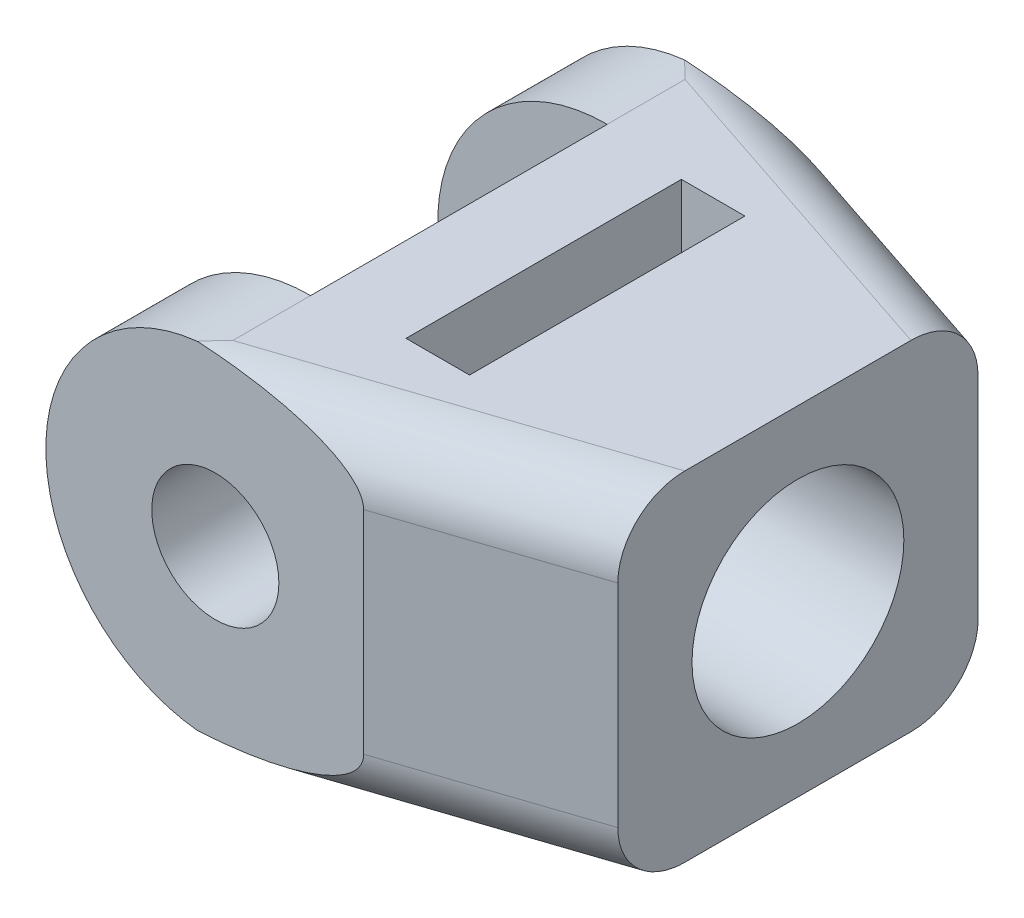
ISO-10303-21;
HEADER;
FILE_DESCRIPTION(('STEP AP214'),'2;1');
FILE_NAME('part.step','',(''),(''),'','','');
FILE_SCHEMA(('AUTOMOTIVE_DESIGN { 1 0 10303 214 1 1 1 1 }'));
ENDSEC;
DATA;
#1=APPLICATION_CONTEXT('core data for automotive mechanical design processes');
#2=APPLICATION_PROTOCOL_DEFINITION('international standard','automotive_design',2000,#1);
#3=PRODUCT_CONTEXT('',#1,'mechanical');
#4=PRODUCT('Part','Part','',(#3));
#5=PRODUCT_RELATED_PRODUCT_CATEGORY('part','',(#4));
#6=PRODUCT_DEFINITION_FORMATION('','',#4);
#7=PRODUCT_DEFINITION_CONTEXT('part definition',#1,'design');
#8=PRODUCT_DEFINITION('design','',#6,#7);
#9=PRODUCT_DEFINITION_SHAPE('','',#8);
#10=(LENGTH_UNIT() NAMED_UNIT(*) SI_UNIT(.MILLI.,.METRE.));
#11=(NAMED_UNIT(*) PLANE_ANGLE_UNIT() SI_UNIT($,.RADIAN.));
#12=(NAMED_UNIT(*) SI_UNIT($,.STERADIAN.) SOLID_ANGLE_UNIT());
#13=UNCERTAINTY_MEASURE_WITH_UNIT(LENGTH_MEASURE(1.E-05),#10,'distance_accuracy_value','');
#14=(GEOMETRIC_REPRESENTATION_CONTEXT(3) GLOBAL_UNCERTAINTY_ASSIGNED_CONTEXT((#13)) GLOBAL_UNIT_ASSIGNED_CONTEXT((#10,
#11,#12)) REPRESENTATION_CONTEXT('',''));
#15=CARTESIAN_POINT('',(0.,0.,0.));
#16=DIRECTION('',(0.,0.,1.));
#17=DIRECTION('',(1.,0.,0.));
#18=AXIS2_PLACEMENT_3D('',#15,#16,#17);
#19=CARTESIAN_POINT('',(-8.001,0.,0.));
#20=DIRECTION('',(1.,0.,0.));
#21=DIRECTION('',(0.,0.,-1.));
#22=AXIS2_PLACEMENT_3D('',#19,#20,#21);
#23=CYLINDRICAL_SURFACE('',#22,5.);
#24=CARTESIAN_POINT('',(4.,0.,0.));
#25=DIRECTION('',(-1.,0.,0.));
#26=DIRECTION('',(0.,0.,1.));
#27=AXIS2_PLACEMENT_3D('',#24,#25,#26);
#28=CIRCLE('',#27,5.);
#29=CARTESIAN_POINT('',(4.,0.,5.));
#30=VERTEX_POINT('',#29);
#31=EDGE_CURVE('E215',#30,#30,#28,.F.);
#32=ORIENTED_EDGE('',*,*,#31,.T.);
#33=EDGE_LOOP('',(#32));
#34=FACE_BOUND('',#33,.T.);
#35=CARTESIAN_POINT('',(-3.,0.,-5.));
#36=CARTESIAN_POINT('',(-2.99999894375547,0.0767697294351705,-4.99999907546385));
#37=CARTESIAN_POINT('',(-2.99704640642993,0.153562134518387,-4.99822567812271));
#38=CARTESIAN_POINT('',(-2.98528576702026,0.306548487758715,-4.99118362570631));
#39=CARTESIAN_POINT('',(-2.97647423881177,0.382742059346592,-4.98591292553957));
#40=CARTESIAN_POINT('',(-2.94135144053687,0.609808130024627,-4.96499345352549));
#41=CARTESIAN_POINT('',(-2.90635229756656,0.758981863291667,-4.94423772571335));
#42=CARTESIAN_POINT('',(-2.81522725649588,1.04754167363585,-4.89123238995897));
#43=CARTESIAN_POINT('',(-2.75920607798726,1.18697226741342,-4.8590397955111));
#44=CARTESIAN_POINT('',(-2.62827933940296,1.45405042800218,-4.7859070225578));
#45=CARTESIAN_POINT('',(-2.55337846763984,1.58170090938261,-4.74496901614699));
#46=CARTESIAN_POINT('',(-2.38045034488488,1.83260160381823,-4.65410731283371));
#47=CARTESIAN_POINT('',(-2.28109260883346,1.95476885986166,-4.60373587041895));
#48=CARTESIAN_POINT('',(-2.06506559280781,2.1817645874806,-4.50060875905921));
#49=CARTESIAN_POINT('',(-1.94837412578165,2.28657046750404,-4.4478500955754));
#50=CARTESIAN_POINT('',(-1.68415297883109,2.48890019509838,-4.33822134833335));
#51=CARTESIAN_POINT('',(-1.53459645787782,2.5839553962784,-4.28164035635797));
#52=CARTESIAN_POINT('',(-1.21830685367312,2.74722868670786,-4.17876602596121));
#53=CARTESIAN_POINT('',(-1.05160220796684,2.8154903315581,-4.13245604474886));
#54=CARTESIAN_POINT('',(-0.7468070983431,2.90881204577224,-4.06709259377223));
#55=CARTESIAN_POINT('',(-0.611528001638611,2.94032394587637,-4.04415766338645));
#56=CARTESIAN_POINT('',(-0.336392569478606,2.98432344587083,-4.01180616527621));
#57=CARTESIAN_POINT('',(-0.196542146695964,2.99683469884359,-4.00237279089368));
#58=CARTESIAN_POINT('',(0.0840229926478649,3.0021101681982,-3.99841845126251));
#59=CARTESIAN_POINT('',(0.224738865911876,2.99483563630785,-4.00392674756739));
#60=CARTESIAN_POINT('',(0.502557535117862,2.96092124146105,-4.02906522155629));
#61=CARTESIAN_POINT('',(0.639657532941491,2.93426681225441,-4.04870602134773));
#62=CARTESIAN_POINT('',(0.905060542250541,2.86347831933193,-4.09906376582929));
#63=CARTESIAN_POINT('',(1.03345432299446,2.8195745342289,-4.12963433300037));
#64=CARTESIAN_POINT('',(1.28138976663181,2.7159016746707,-4.19854092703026));
#65=CARTESIAN_POINT('',(1.40092816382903,2.65612678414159,-4.2368797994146));
#66=CARTESIAN_POINT('',(1.64996913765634,2.5103577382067,-4.32510698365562));
#67=CARTESIAN_POINT('',(1.77755999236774,2.42160671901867,-4.3758426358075));
#68=CARTESIAN_POINT('',(2.01734915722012,2.22582963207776,-4.4786102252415));
#69=CARTESIAN_POINT('',(2.12953256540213,2.11878609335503,-4.53064336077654));
#70=CARTESIAN_POINT('',(2.35124225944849,1.87159040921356,-4.63871766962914));
#71=CARTESIAN_POINT('',(2.45821939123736,1.72890315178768,-4.69430681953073));
#72=CARTESIAN_POINT('',(2.59926871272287,1.50061053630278,-4.77018325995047));
#73=CARTESIAN_POINT('',(2.64306413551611,1.42209821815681,-4.79423315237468));
#74=CARTESIAN_POINT('',(2.723718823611,1.26074368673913,-4.83916496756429));
#75=CARTESIAN_POINT('',(2.76058235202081,1.17790417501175,-4.86004883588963));
#76=CARTESIAN_POINT('',(2.82481144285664,1.01376371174,-4.8968267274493));
#77=CARTESIAN_POINT('',(2.85262656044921,0.932690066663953,-4.91295100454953));
#78=CARTESIAN_POINT('',(2.90133395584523,0.767879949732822,-4.94139126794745));
#79=CARTESIAN_POINT('',(2.92223010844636,0.684144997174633,-4.95370938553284));
#80=CARTESIAN_POINT('',(2.95677185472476,0.514744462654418,-4.97416370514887));
#81=CARTESIAN_POINT('',(2.97042275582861,0.429080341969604,-4.98230296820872));
#82=CARTESIAN_POINT('',(2.99026618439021,0.256621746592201,-4.99415996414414));
#83=CARTESIAN_POINT('',(2.99645976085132,0.169827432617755,-4.99787831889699));
#84=CARTESIAN_POINT('',(3.00299267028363,-0.0673242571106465,-5.00179157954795));
#85=CARTESIAN_POINT('',(2.9958115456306,-0.218056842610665,-4.99746512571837));
#86=CARTESIAN_POINT('',(2.9591544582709,-0.515686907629,-4.97557955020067));
#87=CARTESIAN_POINT('',(2.92967894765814,-0.662584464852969,-4.95802069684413));
#88=CARTESIAN_POINT('',(2.85091154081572,-0.945142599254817,-4.91189447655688));
#89=CARTESIAN_POINT('',(2.80211887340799,-1.08098954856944,-4.88360514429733));
#90=CARTESIAN_POINT('',(2.68664567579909,-1.34253345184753,-4.81827798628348));
#91=CARTESIAN_POINT('',(2.61996161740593,-1.46822839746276,-4.78123843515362));
#92=CARTESIAN_POINT('',(2.46288590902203,-1.72001192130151,-4.69690981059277));
#93=CARTESIAN_POINT('',(2.37075230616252,-1.84478813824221,-4.6489560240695));
#94=CARTESIAN_POINT('',(2.16921724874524,-2.07805222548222,-4.54948534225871));
#95=CARTESIAN_POINT('',(2.05979570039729,-2.18652085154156,-4.49796434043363));
#96=CARTESIAN_POINT('',(1.81017920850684,-2.39863988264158,-4.38890846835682));
#97=CARTESIAN_POINT('',(1.66783222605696,-2.49982037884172,-4.33146483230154));
#98=CARTESIAN_POINT('',(1.36556795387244,-2.67690479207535,-4.22432364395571));
#99=CARTESIAN_POINT('',(1.20566941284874,-2.75283533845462,-4.1746179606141));
#100=CARTESIAN_POINT('',(0.907513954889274,-2.86285157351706,-4.09969818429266));
#101=CARTESIAN_POINT('',(0.772039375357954,-2.90243250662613,-4.07151318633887));
#102=CARTESIAN_POINT('',(0.494935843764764,-2.96227327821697,-4.02819211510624));
#103=CARTESIAN_POINT('',(0.353315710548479,-2.98255990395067,-4.01303795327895));
#104=CARTESIAN_POINT('',(0.0672461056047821,-3.00268261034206,-3.99800893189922));
#105=CARTESIAN_POINT('',(-0.0772119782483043,-3.00244179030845,-3.99819152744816));
#106=CARTESIAN_POINT('',(-0.363788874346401,-2.98132945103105,-4.01395435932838));
#107=CARTESIAN_POINT('',(-0.505906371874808,-2.96044671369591,-4.02954296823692));
#108=CARTESIAN_POINT('',(-0.776976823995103,-2.90080351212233,-4.07266369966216));
#109=CARTESIAN_POINT('',(-0.90623414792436,-2.86295284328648,-4.09958421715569));
#110=CARTESIAN_POINT('',(-1.15667454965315,-2.77126473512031,-4.16211005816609));
#111=CARTESIAN_POINT('',(-1.27785456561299,-2.7174212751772,-4.19771865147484));
#112=CARTESIAN_POINT('',(-1.52863953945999,-2.58578536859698,-4.28025972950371));
#113=CARTESIAN_POINT('',(-1.65668150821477,-2.50558518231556,-4.32809142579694));
#114=CARTESIAN_POINT('',(-1.8987608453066,-2.32751213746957,-4.42640286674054));
#115=CARTESIAN_POINT('',(-2.01278655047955,-2.22962472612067,-4.47688476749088));
#116=CARTESIAN_POINT('',(-2.24269884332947,-2.00020353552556,-4.5845123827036));
#117=CARTESIAN_POINT('',(-2.35584987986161,-1.86578571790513,-4.64140045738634));
#118=CARTESIAN_POINT('',(-2.55820798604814,-1.57689277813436,-4.74731429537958));
#119=CARTESIAN_POINT('',(-2.64740647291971,-1.42241049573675,-4.79633723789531));
#120=CARTESIAN_POINT('',(-2.75912447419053,-1.18102189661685,-4.85920558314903));
#121=CARTESIAN_POINT('',(-2.79233599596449,-1.10025014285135,-4.87817139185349));
#122=CARTESIAN_POINT('',(-2.85177213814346,-0.935442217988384,-4.91243413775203));
#123=CARTESIAN_POINT('',(-2.87800083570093,-0.851407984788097,-4.9277332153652));
#124=CARTESIAN_POINT('',(-2.92300944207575,-0.68100181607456,-4.95415527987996));
#125=CARTESIAN_POINT('',(-2.94181107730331,-0.594637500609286,-4.9652904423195));
#126=CARTESIAN_POINT('',(-2.97174435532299,-0.420183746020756,-4.98308318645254));
#127=CARTESIAN_POINT('',(-2.98288238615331,-0.332095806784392,-4.98974449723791));
#128=CARTESIAN_POINT('',(-2.99339168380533,-0.203123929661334,-4.99603728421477));
#129=CARTESIAN_POINT('',(-2.995868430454,-0.162556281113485,-4.99752198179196));
#130=CARTESIAN_POINT('',(-2.99917289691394,-0.0813278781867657,-4.99950360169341));
#131=CARTESIAN_POINT('',(-3.00000055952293,-0.0406671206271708,-5.00000048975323));
#132=CARTESIAN_POINT('',(-3.,0.,-5.));
#133=B_SPLINE_CURVE_WITH_KNOTS('',3,(#35,#36,#37,#38,#39,#40,#41,#42,#43,#44,#45,#46,#47,#48,
#49,#50,#51,#52,#53,#54,#55,#56,#57,#58,#59,#60,#61,#62,#63,#64,#65,#66,#67,#68,#69,#70,#71,#72,
#73,#74,#75,#76,#77,#78,#79,#80,#81,#82,#83,#84,#85,#86,#87,#88,#89,#90,#91,#92,#93,#94,#95,#96,
#97,#98,#99,#100,#101,#102,#103,#104,#105,#106,#107,#108,#109,#110,#111,#112,#113,#114,#115,
#116,#117,#118,#119,#120,#121,#122,#123,#124,#125,#126,#127,#128,#129,#130,#131,#132),
.UNSPECIFIED.,.T.,.F.,(4,2,2,2,2,2,2,2,2,2,2,2,2,2,2,2,2,2,2,2,2,2,2,2,2,2,2,2,2,2,2,2,2,2,2,2,
2,2,2,2,2,2,2,2,2,2,2,2,4),(0.,0.230263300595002,0.4606613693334,0.922002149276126,
1.38107466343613,1.84003329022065,2.33408870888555,2.82878205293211,3.38413315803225,
3.93857770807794,4.35913349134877,4.77916531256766,5.20002031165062,5.62119195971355,
6.03692224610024,6.45280509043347,6.94139679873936,7.43045779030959,7.98767605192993,
8.26653157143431,8.54521503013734,8.80648473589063,9.06760787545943,9.32853946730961,
9.58943435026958,10.0398406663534,10.490237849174,10.9296843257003,11.3692175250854,
11.8543559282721,12.3400624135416,12.8890638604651,13.437484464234,13.8674843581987,
14.2968863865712,14.7278971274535,15.1591422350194,15.5696105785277,15.9802336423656,
16.4539008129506,16.927959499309,17.4794148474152,18.0310675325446,18.2988384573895,
18.5664526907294,18.8332781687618,19.0998809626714,19.221853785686,19.3438308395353),.UNSPECIFIED.);
#134=CARTESIAN_POINT('',(0.,3.,-4.));
#135=VERTEX_POINT('',#134);
#136=CARTESIAN_POINT('',(0.,-3.,-4.));
#137=VERTEX_POINT('',#136);
#138=EDGE_CURVE('E223',#135,#137,#133,.T.);
#139=ORIENTED_EDGE('',*,*,#138,.T.);
#140=CARTESIAN_POINT('',(0.,0.,0.));
#141=DIRECTION('',(1.,0.,0.));
#142=DIRECTION('',(0.,0.,-1.));
#143=AXIS2_PLACEMENT_3D('',#140,#141,#142);
#144=CIRCLE('',#143,5.);
#145=CARTESIAN_POINT('',(0.,-3.,4.));
#146=VERTEX_POINT('',#145);
#147=EDGE_CURVE('E214',#137,#146,#144,.F.);
#148=ORIENTED_EDGE('',*,*,#147,.T.);
#149=CARTESIAN_POINT('',(3.,0.,5.));
#150=CARTESIAN_POINT('',(2.99999894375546,0.0767697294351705,4.99999907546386));
#151=CARTESIAN_POINT('',(2.99704640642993,0.153562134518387,4.99822567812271));
#152=CARTESIAN_POINT('',(2.98528576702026,0.306548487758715,4.99118362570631));
#153=CARTESIAN_POINT('',(2.97647423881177,0.382742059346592,4.98591292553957));
#154=CARTESIAN_POINT('',(2.94135144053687,0.609808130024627,4.96499345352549));
#155=CARTESIAN_POINT('',(2.90635229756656,0.758981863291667,4.94423772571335));
#156=CARTESIAN_POINT('',(2.81522725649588,1.04754167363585,4.89123238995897));
#157=CARTESIAN_POINT('',(2.75920607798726,1.18697226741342,4.8590397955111));
#158=CARTESIAN_POINT('',(2.62827933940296,1.45405042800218,4.7859070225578));
#159=CARTESIAN_POINT('',(2.55337846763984,1.58170090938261,4.74496901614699));
#160=CARTESIAN_POINT('',(2.38045034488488,1.83260160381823,4.65410731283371));
#161=CARTESIAN_POINT('',(2.28109260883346,1.95476885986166,4.60373587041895));
#162=CARTESIAN_POINT('',(2.06506559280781,2.1817645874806,4.50060875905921));
#163=CARTESIAN_POINT('',(1.94837412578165,2.28657046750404,4.4478500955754));
#164=CARTESIAN_POINT('',(1.68415297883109,2.48890019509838,4.33822134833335));
#165=CARTESIAN_POINT('',(1.53459645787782,2.5839553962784,4.28164035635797));
#166=CARTESIAN_POINT('',(1.21830685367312,2.74722868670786,4.17876602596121));
#167=CARTESIAN_POINT('',(1.05160220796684,2.8154903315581,4.13245604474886));
#168=CARTESIAN_POINT('',(0.746807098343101,2.90881204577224,4.06709259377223));
#169=CARTESIAN_POINT('',(0.611528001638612,2.94032394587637,4.04415766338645));
#170=CARTESIAN_POINT('',(0.336392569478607,2.98432344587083,4.01180616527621));
#171=CARTESIAN_POINT('',(0.196542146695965,2.99683469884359,4.00237279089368));
#172=CARTESIAN_POINT('',(-0.0840229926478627,3.0021101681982,3.99841845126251));
#173=CARTESIAN_POINT('',(-0.224738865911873,2.99483563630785,4.00392674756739));
#174=CARTESIAN_POINT('',(-0.502557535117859,2.96092124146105,4.02906522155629));
#175=CARTESIAN_POINT('',(-0.639657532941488,2.93426681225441,4.04870602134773));
#176=CARTESIAN_POINT('',(-0.905060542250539,2.86347831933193,4.09906376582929));
#177=CARTESIAN_POINT('',(-1.03345432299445,2.8195745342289,4.12963433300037));
#178=CARTESIAN_POINT('',(-1.2813897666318,2.71590167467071,4.19854092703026));
#179=CARTESIAN_POINT('',(-1.40092816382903,2.65612678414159,4.2368797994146));
#180=CARTESIAN_POINT('',(-1.64996913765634,2.5103577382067,4.32510698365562));
#181=CARTESIAN_POINT('',(-1.77755999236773,2.42160671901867,4.3758426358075));
#182=CARTESIAN_POINT('',(-2.01734915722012,2.22582963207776,4.4786102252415));
#183=CARTESIAN_POINT('',(-2.12953256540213,2.11878609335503,4.53064336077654));
#184=CARTESIAN_POINT('',(-2.35124225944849,1.87159040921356,4.63871766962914));
#185=CARTESIAN_POINT('',(-2.45821939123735,1.72890315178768,4.69430681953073));
#186=CARTESIAN_POINT('',(-2.59926871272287,1.50061053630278,4.77018325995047));
#187=CARTESIAN_POINT('',(-2.64306413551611,1.42209821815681,4.79423315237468));
#188=CARTESIAN_POINT('',(-2.723718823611,1.26074368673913,4.83916496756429));
#189=CARTESIAN_POINT('',(-2.76058235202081,1.17790417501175,4.86004883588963));
#190=CARTESIAN_POINT('',(-2.82481144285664,1.01376371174,4.8968267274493));
#191=CARTESIAN_POINT('',(-2.85262656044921,0.932690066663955,4.91295100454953));
#192=CARTESIAN_POINT('',(-2.90133395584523,0.767879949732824,4.94139126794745));
#193=CARTESIAN_POINT('',(-2.92223010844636,0.684144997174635,4.95370938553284));
#194=CARTESIAN_POINT('',(-2.95677185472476,0.514744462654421,4.97416370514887));
#195=CARTESIAN_POINT('',(-2.97042275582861,0.429080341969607,4.98230296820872));
#196=CARTESIAN_POINT('',(-2.99026618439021,0.256621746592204,4.99415996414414));
#197=CARTESIAN_POINT('',(-2.99645976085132,0.169827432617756,4.99787831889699));
#198=CARTESIAN_POINT('',(-3.00299267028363,-0.067324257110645,5.00179157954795));
#199=CARTESIAN_POINT('',(-2.9958115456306,-0.218056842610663,4.99746512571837));
#200=CARTESIAN_POINT('',(-2.9591544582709,-0.515686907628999,4.97557955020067));
#201=CARTESIAN_POINT('',(-2.92967894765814,-0.662584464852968,4.95802069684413));
#202=CARTESIAN_POINT('',(-2.85091154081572,-0.945142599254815,4.91189447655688));
#203=CARTESIAN_POINT('',(-2.80211887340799,-1.08098954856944,4.88360514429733));
#204=CARTESIAN_POINT('',(-2.68664567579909,-1.34253345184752,4.81827798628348));
#205=CARTESIAN_POINT('',(-2.61996161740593,-1.46822839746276,4.78123843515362));
#206=CARTESIAN_POINT('',(-2.46288590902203,-1.7200119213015,4.69690981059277));
#207=CARTESIAN_POINT('',(-2.37075230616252,-1.84478813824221,4.6489560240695));
#208=CARTESIAN_POINT('',(-2.16921724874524,-2.07805222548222,4.54948534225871));
#209=CARTESIAN_POINT('',(-2.05979570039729,-2.18652085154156,4.49796434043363));
#210=CARTESIAN_POINT('',(-1.81017920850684,-2.39863988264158,4.38890846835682));
#211=CARTESIAN_POINT('',(-1.66783222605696,-2.49982037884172,4.33146483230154));
#212=CARTESIAN_POINT('',(-1.36556795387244,-2.67690479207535,4.22432364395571));
#213=CARTESIAN_POINT('',(-1.20566941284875,-2.75283533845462,4.1746179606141));
#214=CARTESIAN_POINT('',(-0.907513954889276,-2.86285157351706,4.09969818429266));
#215=CARTESIAN_POINT('',(-0.772039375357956,-2.90243250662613,4.07151318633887));
#216=CARTESIAN_POINT('',(-0.494935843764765,-2.96227327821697,4.02819211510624));
#217=CARTESIAN_POINT('',(-0.35331571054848,-2.98255990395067,4.01303795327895));
#218=CARTESIAN_POINT('',(-0.0672461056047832,-3.00268261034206,3.99800893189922));
#219=CARTESIAN_POINT('',(0.0772119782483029,-3.00244179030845,3.99819152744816));
#220=CARTESIAN_POINT('',(0.3637888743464,-2.98132945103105,4.01395435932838));
#221=CARTESIAN_POINT('',(0.505906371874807,-2.96044671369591,4.02954296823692));
#222=CARTESIAN_POINT('',(0.776976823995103,-2.90080351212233,4.07266369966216));
#223=CARTESIAN_POINT('',(0.906234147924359,-2.86295284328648,4.09958421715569));
#224=CARTESIAN_POINT('',(1.15667454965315,-2.77126473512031,4.16211005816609));
#225=CARTESIAN_POINT('',(1.27785456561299,-2.7174212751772,4.19771865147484));
#226=CARTESIAN_POINT('',(1.52863953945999,-2.58578536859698,4.28025972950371));
#227=CARTESIAN_POINT('',(1.65668150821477,-2.50558518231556,4.32809142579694));
#228=CARTESIAN_POINT('',(1.8987608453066,-2.32751213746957,4.42640286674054));
#229=CARTESIAN_POINT('',(2.01278655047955,-2.22962472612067,4.47688476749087));
#230=CARTESIAN_POINT('',(2.24269884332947,-2.00020353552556,4.5845123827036));
#231=CARTESIAN_POINT('',(2.35584987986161,-1.86578571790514,4.64140045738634));
#232=CARTESIAN_POINT('',(2.55820798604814,-1.57689277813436,4.74731429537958));
#233=CARTESIAN_POINT('',(2.64740647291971,-1.42241049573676,4.79633723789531));
#234=CARTESIAN_POINT('',(2.75912447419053,-1.18102189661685,4.85920558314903));
#235=CARTESIAN_POINT('',(2.79233599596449,-1.10025014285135,4.87817139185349));
#236=CARTESIAN_POINT('',(2.85177213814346,-0.935442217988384,4.91243413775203));
#237=CARTESIAN_POINT('',(2.87800083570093,-0.851407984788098,4.9277332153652));
#238=CARTESIAN_POINT('',(2.92300944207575,-0.681001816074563,4.95415527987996));
#239=CARTESIAN_POINT('',(2.9418110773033,-0.594637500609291,4.9652904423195));
#240=CARTESIAN_POINT('',(2.97174435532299,-0.420183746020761,4.98308318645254));
#241=CARTESIAN_POINT('',(2.98288238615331,-0.332095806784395,4.98974449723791));
#242=CARTESIAN_POINT('',(2.99339168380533,-0.203123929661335,4.99603728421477));
#243=CARTESIAN_POINT('',(2.995868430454,-0.162556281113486,4.99752198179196));
#244=CARTESIAN_POINT('',(2.99917289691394,-0.0813278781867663,4.99950360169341));
#245=CARTESIAN_POINT('',(3.00000055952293,-0.0406671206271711,5.00000048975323));
#246=CARTESIAN_POINT('',(3.,0.,5.));
#247=B_SPLINE_CURVE_WITH_KNOTS('',3,(#149,#150,#151,#152,#153,#154,#155,#156,#157,#158,#159,
#160,#161,#162,#163,#164,#165,#166,#167,#168,#169,#170,#171,#172,#173,#174,#175,#176,#177,#178,
#179,#180,#181,#182,#183,#184,#185,#186,#187,#188,#189,#190,#191,#192,#193,#194,#195,#196,#197,
#198,#199,#200,#201,#202,#203,#204,#205,#206,#207,#208,#209,#210,#211,#212,#213,#214,#215,#216,
#217,#218,#219,#220,#221,#222,#223,#224,#225,#226,#227,#228,#229,#230,#231,#232,#233,#234,#235,
#236,#237,#238,#239,#240,#241,#242,#243,#244,#245,#246),.UNSPECIFIED.,.T.,.F.,(4,2,2,2,2,2,2,2,
2,2,2,2,2,2,2,2,2,2,2,2,2,2,2,2,2,2,2,2,2,2,2,2,2,2,2,2,2,2,2,2,2,2,2,2,2,2,2,2,4),(0.,
0.230263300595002,0.4606613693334,0.922002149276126,1.38107466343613,1.84003329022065,
2.33408870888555,2.82878205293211,3.38413315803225,3.93857770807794,4.35913349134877,
4.77916531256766,5.20002031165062,5.62119195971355,6.03692224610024,6.45280509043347,
6.94139679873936,7.43045779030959,7.98767605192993,8.26653157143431,8.54521503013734,
8.80648473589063,9.06760787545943,9.32853946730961,9.58943435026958,10.0398406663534,
10.490237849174,10.9296843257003,11.3692175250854,11.8543559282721,12.3400624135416,
12.889063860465,13.437484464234,13.8674843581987,14.2968863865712,14.7278971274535,
15.1591422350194,15.5696105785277,15.9802336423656,16.4539008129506,16.927959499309,
17.4794148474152,18.0310675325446,18.2988384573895,18.5664526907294,18.8332781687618,
19.0998809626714,19.221853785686,19.3438308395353),.UNSPECIFIED.);
#248=CARTESIAN_POINT('',(0.,3.,4.));
#249=VERTEX_POINT('',#248);
#250=EDGE_CURVE('E217',#146,#249,#247,.T.);
#251=ORIENTED_EDGE('',*,*,#250,.T.);
#252=CARTESIAN_POINT('',(0.,0.,0.));
#253=DIRECTION('',(-1.,0.,0.));
#254=DIRECTION('',(0.,0.,1.));
#255=AXIS2_PLACEMENT_3D('',#252,#253,#254);
#256=CIRCLE('',#255,5.);
#257=EDGE_CURVE('E451',#135,#249,#256,.F.);
#258=ORIENTED_EDGE('',*,*,#257,.F.);
#259=EDGE_LOOP('',(#139,#148,#251,#258));
#260=FACE_BOUND('',#259,.T.);
#261=ADVANCED_FACE('F32',(#34,#260),#23,.F.);
#262=CARTESIAN_POINT('',(0.,0.,-11.5));
#263=DIRECTION('',(0.,0.,1.));
#264=DIRECTION('',(1.,0.,0.));
#265=AXIS2_PLACEMENT_3D('',#262,#263,#264);
#266=CYLINDRICAL_SURFACE('',#265,3.);
#267=CARTESIAN_POINT('',(0.,0.,11.5));
#268=DIRECTION('',(0.,0.,1.));
#269=DIRECTION('',(1.,0.,0.));
#270=AXIS2_PLACEMENT_3D('',#267,#268,#269);
#271=CIRCLE('',#270,3.);
#272=CARTESIAN_POINT('',(3.,0.,11.5));
#273=VERTEX_POINT('',#272);
#274=EDGE_CURVE('E424',#273,#273,#271,.T.);
#275=ORIENTED_EDGE('',*,*,#274,.T.);
#276=EDGE_LOOP('',(#275));
#277=FACE_BOUND('',#276,.T.);
#278=DIRECTION('',(0.,0.,1.));
#279=VECTOR('',#278,1.);
#280=CARTESIAN_POINT('',(0.,3.,-11.5));
#281=LINE('',#280,#279);
#282=CARTESIAN_POINT('',(0.,3.,7.));
#283=VERTEX_POINT('',#282);
#284=EDGE_CURVE('E473',#283,#249,#281,.F.);
#285=ORIENTED_EDGE('',*,*,#284,.T.);
#286=ORIENTED_EDGE('',*,*,#250,.F.);
#287=DIRECTION('',(0.,0.,1.));
#288=VECTOR('',#287,1.);
#289=CARTESIAN_POINT('',(0.,-3.,-11.5));
#290=LINE('',#289,#288);
#291=CARTESIAN_POINT('',(0.,-3.,7.));
#292=VERTEX_POINT('',#291);
#293=EDGE_CURVE('E453',#292,#146,#290,.F.);
#294=ORIENTED_EDGE('',*,*,#293,.F.);
#295=CARTESIAN_POINT('',(0.,0.,7.));
#296=DIRECTION('',(0.,0.,-1.));
#297=DIRECTION('',(-1.,0.,0.));
#298=AXIS2_PLACEMENT_3D('',#295,#296,#297);
#299=CIRCLE('',#298,3.);
#300=EDGE_CURVE('E466',#292,#283,#299,.T.);
#301=ORIENTED_EDGE('',*,*,#300,.T.);
#302=EDGE_LOOP('',(#285,#286,#294,#301));
#303=FACE_BOUND('',#302,.T.);
#304=ADVANCED_FACE('F261',(#277,#303),#266,.F.);
#305=CARTESIAN_POINT('',(0.,0.,-11.5));
#306=DIRECTION('',(0.,0.,1.));
#307=DIRECTION('',(1.,0.,0.));
#308=AXIS2_PLACEMENT_3D('',#305,#306,#307);
#309=CYLINDRICAL_SURFACE('',#308,8.);
#310=DIRECTION('',(0.,0.,1.));
#311=VECTOR('',#310,1.);
#312=CARTESIAN_POINT('',(0.,8.,-11.5));
#313=LINE('',#312,#311);
#314=CARTESIAN_POINT('',(0.,8.,-10.671055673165));
#315=VERTEX_POINT('',#314);
#316=CARTESIAN_POINT('',(0.,8.,-7.));
#317=VERTEX_POINT('',#316);
#318=EDGE_CURVE('E398',#315,#317,#313,.T.);
#319=ORIENTED_EDGE('',*,*,#318,.F.);
#320=CARTESIAN_POINT('',(-0.84819103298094,7.95490867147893,-11.5));
#321=CARTESIAN_POINT('',(-0.709054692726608,7.96973607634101,-11.3644457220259));
#322=CARTESIAN_POINT('',(-0.56986490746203,7.98089330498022,-11.2285251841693));
#323=CARTESIAN_POINT('',(-0.291541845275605,7.99590169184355,-10.9564210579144));
#324=CARTESIAN_POINT('',(-0.152408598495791,7.99975803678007,-10.820237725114));
#325=CARTESIAN_POINT('',(-0.00885754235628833,7.99999631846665,-10.6797257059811));
#326=CARTESIAN_POINT('',(-0.00442876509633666,7.99999999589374,-10.6753906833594));
#327=CARTESIAN_POINT('',(0.,8.,-10.671055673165));
#328=B_SPLINE_CURVE_WITH_KNOTS('',3,(#320,#321,#322,#323,#324,#325,#326,#327),.UNSPECIFIED.,.F.,
.F.,(4,2,2,4),(0.,0.584445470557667,1.16847558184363,1.18706747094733),.UNSPECIFIED.);
#329=CARTESIAN_POINT('',(-0.848191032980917,7.95490867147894,-11.5));
#330=VERTEX_POINT('',#329);
#331=EDGE_CURVE('E54',#315,#330,#328,.F.);
#332=ORIENTED_EDGE('',*,*,#331,.T.);
#333=CARTESIAN_POINT('',(0.,0.,-11.5));
#334=DIRECTION('',(0.,0.,1.));
#335=DIRECTION('',(1.,0.,0.));
#336=AXIS2_PLACEMENT_3D('',#333,#334,#335);
#337=CIRCLE('',#336,8.);
#338=CARTESIAN_POINT('',(-0.8481910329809,-7.95490867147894,-11.5));
#339=VERTEX_POINT('',#338);
#340=EDGE_CURVE('E427',#330,#339,#337,.T.);
#341=ORIENTED_EDGE('',*,*,#340,.T.);
#342=CARTESIAN_POINT('',(-0.8481910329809,-7.95490867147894,-11.5));
#343=CARTESIAN_POINT('',(-0.70905469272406,-7.96973607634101,-11.3644457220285));
#344=CARTESIAN_POINT('',(-0.569864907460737,-7.98089330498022,-11.2285251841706));
#345=CARTESIAN_POINT('',(-0.291541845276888,-7.99590169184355,-10.9564210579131));
#346=CARTESIAN_POINT('',(-0.152408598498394,-7.99975803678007,-10.8202377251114));
#347=CARTESIAN_POINT('',(-0.0088575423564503,-7.99999631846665,-10.679725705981));
#348=CARTESIAN_POINT('',(-0.00442876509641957,-7.99999999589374,-10.6753906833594));
#349=CARTESIAN_POINT('',(0.,-8.,-10.671055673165));
#350=B_SPLINE_CURVE_WITH_KNOTS('',3,(#342,#343,#344,#345,#346,#347,#348,#349),.UNSPECIFIED.,.F.,
.F.,(4,2,2,4),(0.,0.58444547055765,1.1684755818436,1.18706747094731),.UNSPECIFIED.);
#351=CARTESIAN_POINT('',(0.,-8.,-10.671055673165));
#352=VERTEX_POINT('',#351);
#353=EDGE_CURVE('E325',#339,#352,#350,.T.);
#354=ORIENTED_EDGE('',*,*,#353,.T.);
#355=DIRECTION('',(0.,0.,1.));
#356=VECTOR('',#355,1.);
#357=CARTESIAN_POINT('',(0.,-8.,-11.5));
#358=LINE('',#357,#356);
#359=CARTESIAN_POINT('',(0.,-8.,-7.));
#360=VERTEX_POINT('',#359);
#361=EDGE_CURVE('E392',#352,#360,#358,.T.);
#362=ORIENTED_EDGE('',*,*,#361,.T.);
#363=CARTESIAN_POINT('',(0.,0.,-7.));
#364=DIRECTION('',(0.,0.,1.));
#365=DIRECTION('',(1.,0.,0.));
#366=AXIS2_PLACEMENT_3D('',#363,#364,#365);
#367=CIRCLE('',#366,8.);
#368=EDGE_CURVE('E477',#317,#360,#367,.T.);
#369=ORIENTED_EDGE('',*,*,#368,.F.);
#370=EDGE_LOOP('',(#319,#332,#341,#354,#362,#369));
#371=FACE_BOUND('',#370,.T.);
#372=ADVANCED_FACE('F268',(#371),#309,.T.);
#373=CARTESIAN_POINT('',(0.,-8.,7.));
#374=VERTEX_POINT('',#373);
#375=CARTESIAN_POINT('',(0.,-8.,10.671055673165));
#376=VERTEX_POINT('',#375);
#377=EDGE_CURVE('E435',#374,#376,#358,.T.);
#378=ORIENTED_EDGE('',*,*,#377,.T.);
#379=CARTESIAN_POINT('',(-0.848191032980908,-7.95490867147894,11.5));
#380=CARTESIAN_POINT('',(-0.70905469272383,-7.96973607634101,11.3644457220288));
#381=CARTESIAN_POINT('',(-0.569864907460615,-7.98089330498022,11.2285251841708));
#382=CARTESIAN_POINT('',(-0.291541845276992,-7.99590169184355,10.956421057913));
#383=CARTESIAN_POINT('',(-0.152408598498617,-7.99975803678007,10.8202377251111));
#384=CARTESIAN_POINT('',(-0.00885754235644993,-7.99999631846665,10.6797257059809));
#385=CARTESIAN_POINT('',(-0.00442876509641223,-7.99999999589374,10.6753906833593));
#386=CARTESIAN_POINT('',(0.,-8.,10.671055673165));
#387=B_SPLINE_CURVE_WITH_KNOTS('',3,(#379,#380,#381,#382,#383,#384,#385,#386),.UNSPECIFIED.,.F.,
.F.,(4,2,2,4),(0.,0.584445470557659,1.16847558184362,1.18706747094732),.UNSPECIFIED.);
#388=CARTESIAN_POINT('',(-0.848191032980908,-7.95490867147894,11.5));
#389=VERTEX_POINT('',#388);
#390=EDGE_CURVE('E319',#376,#389,#387,.F.);
#391=ORIENTED_EDGE('',*,*,#390,.T.);
#392=CARTESIAN_POINT('',(0.,0.,11.5));
#393=DIRECTION('',(0.,0.,1.));
#394=DIRECTION('',(1.,0.,0.));
#395=AXIS2_PLACEMENT_3D('',#392,#393,#394);
#396=CIRCLE('',#395,8.);
#397=CARTESIAN_POINT('',(-0.84819103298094,7.95490867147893,11.5));
#398=VERTEX_POINT('',#397);
#399=EDGE_CURVE('E422',#398,#389,#396,.T.);
#400=ORIENTED_EDGE('',*,*,#399,.F.);
#401=CARTESIAN_POINT('',(-0.84819103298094,7.95490867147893,11.5));
#402=CARTESIAN_POINT('',(-0.709054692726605,7.96973607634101,11.3644457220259));
#403=CARTESIAN_POINT('',(-0.569864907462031,7.98089330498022,11.2285251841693));
#404=CARTESIAN_POINT('',(-0.29154184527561,7.99590169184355,10.9564210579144));
#405=CARTESIAN_POINT('',(-0.152408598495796,7.99975803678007,10.820237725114));
#406=CARTESIAN_POINT('',(-0.00885754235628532,7.99999631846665,10.6797257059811));
#407=CARTESIAN_POINT('',(-0.00442876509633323,7.99999999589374,10.6753906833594));
#408=CARTESIAN_POINT('',(0.,8.,10.671055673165));
#409=B_SPLINE_CURVE_WITH_KNOTS('',3,(#401,#402,#403,#404,#405,#406,#407,#408),.UNSPECIFIED.,.F.,
.F.,(4,2,2,4),(0.,0.584445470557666,1.16847558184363,1.18706747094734),.UNSPECIFIED.);
#410=CARTESIAN_POINT('',(0.,8.,10.671055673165));
#411=VERTEX_POINT('',#410);
#412=EDGE_CURVE('E311',#398,#411,#409,.T.);
#413=ORIENTED_EDGE('',*,*,#412,.T.);
#414=CARTESIAN_POINT('',(0.,8.,7.));
#415=VERTEX_POINT('',#414);
#416=EDGE_CURVE('E437',#415,#411,#313,.T.);
#417=ORIENTED_EDGE('',*,*,#416,.F.);
#418=CARTESIAN_POINT('',(0.,0.,7.));
#419=DIRECTION('',(0.,0.,-1.));
#420=DIRECTION('',(-1.,0.,0.));
#421=AXIS2_PLACEMENT_3D('',#418,#419,#420);
#422=CIRCLE('',#421,8.);
#423=EDGE_CURVE('E445',#374,#415,#422,.T.);
#424=ORIENTED_EDGE('',*,*,#423,.F.);
#425=EDGE_LOOP('',(#378,#391,#400,#413,#417,#424));
#426=FACE_BOUND('',#425,.T.);
#427=ADVANCED_FACE('F305',(#426),#309,.T.);
#428=CARTESIAN_POINT('',(0.,0.,-11.5));
#429=DIRECTION('',(0.,0.,1.));
#430=DIRECTION('',(1.,0.,0.));
#431=AXIS2_PLACEMENT_3D('',#428,#429,#430);
#432=CIRCLE('',#431,3.);
#433=CARTESIAN_POINT('',(3.,0.,-11.5));
#434=VERTEX_POINT('',#433);
#435=EDGE_CURVE('E423',#434,#434,#432,.T.);
#436=ORIENTED_EDGE('',*,*,#435,.F.);
#437=EDGE_LOOP('',(#436));
#438=FACE_BOUND('',#437,.T.);
#439=CARTESIAN_POINT('',(0.,-3.,-7.));
#440=VERTEX_POINT('',#439);
#441=EDGE_CURVE('E450',#137,#440,#290,.F.);
#442=ORIENTED_EDGE('',*,*,#441,.F.);
#443=ORIENTED_EDGE('',*,*,#138,.F.);
#444=CARTESIAN_POINT('',(0.,3.,-7.));
#445=VERTEX_POINT('',#444);
#446=EDGE_CURVE('E472',#135,#445,#281,.F.);
#447=ORIENTED_EDGE('',*,*,#446,.T.);
#448=CARTESIAN_POINT('',(0.,0.,-7.));
#449=DIRECTION('',(0.,0.,1.));
#450=DIRECTION('',(1.,0.,0.));
#451=AXIS2_PLACEMENT_3D('',#448,#449,#450);
#452=CIRCLE('',#451,3.);
#453=EDGE_CURVE('E469',#445,#440,#452,.T.);
#454=ORIENTED_EDGE('',*,*,#453,.T.);
#455=EDGE_LOOP('',(#442,#443,#447,#454));
#456=FACE_BOUND('',#455,.T.);
#457=ADVANCED_FACE('F271',(#438,#456),#266,.F.);
#458=CARTESIAN_POINT('',(0.,8.,-11.5));
#459=DIRECTION('',(0.,1.,0.));
#460=DIRECTION('',(0.,0.,1.));
#461=AXIS2_PLACEMENT_3D('',#458,#459,#460);
#462=PLANE('',#461);
#463=ORIENTED_EDGE('',*,*,#416,.T.);
#464=DIRECTION('',(-0.948683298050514,0.,0.316227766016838));
#465=VECTOR('',#464,1.);
#466=CARTESIAN_POINT('',(15.0513167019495,8.,5.65395010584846));
#467=LINE('',#466,#465);
#468=CARTESIAN_POINT('',(16.,8.,5.33772233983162));
#469=VERTEX_POINT('',#468);
#470=EDGE_CURVE('E349',#411,#469,#467,.F.);
#471=ORIENTED_EDGE('',*,*,#470,.T.);
#472=DIRECTION('',(0.,0.,1.));
#473=VECTOR('',#472,1.);
#474=CARTESIAN_POINT('',(16.,8.,-11.5));
#475=LINE('',#474,#473);
#476=CARTESIAN_POINT('',(16.,8.,-5.33772233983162));
#477=VERTEX_POINT('',#476);
#478=EDGE_CURVE('E438',#477,#469,#475,.T.);
#479=ORIENTED_EDGE('',*,*,#478,.F.);
#480=DIRECTION('',(0.948683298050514,0.,0.316227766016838));
#481=VECTOR('',#480,1.);
#482=CARTESIAN_POINT('',(6.05131670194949,8.,-8.65395010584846));
#483=LINE('',#482,#481);
#484=EDGE_CURVE('E357',#477,#315,#483,.F.);
#485=ORIENTED_EDGE('',*,*,#484,.T.);
#486=ORIENTED_EDGE('',*,*,#318,.T.);
#487=DIRECTION('',(0.,0.,1.));
#488=VECTOR('',#487,1.);
#489=CARTESIAN_POINT('',(0.,8.,-11.5));
#490=LINE('',#489,#488);
#491=EDGE_CURVE('E461',#317,#415,#490,.T.);
#492=ORIENTED_EDGE('',*,*,#491,.T.);
#493=EDGE_LOOP('',(#463,#471,#479,#485,#486,#492));
#494=FACE_BOUND('',#493,.T.);
#495=DIRECTION('',(-1.,0.,0.));
#496=VECTOR('',#495,1.);
#497=CARTESIAN_POINT('',(4.,8.,-6.5));
#498=LINE('',#497,#496);
#499=CARTESIAN_POINT('',(7.,8.,-6.5));
#500=VERTEX_POINT('',#499);
#501=CARTESIAN_POINT('',(4.,8.,-6.5));
#502=VERTEX_POINT('',#501);
#503=EDGE_CURVE('E188',#500,#502,#498,.T.);
#504=ORIENTED_EDGE('',*,*,#503,.F.);
#505=DIRECTION('',(0.,0.,-1.));
#506=VECTOR('',#505,1.);
#507=CARTESIAN_POINT('',(7.,8.,-6.5));
#508=LINE('',#507,#506);
#509=CARTESIAN_POINT('',(7.,8.,6.5));
#510=VERTEX_POINT('',#509);
#511=EDGE_CURVE('E199',#510,#500,#508,.T.);
#512=ORIENTED_EDGE('',*,*,#511,.F.);
#513=DIRECTION('',(1.,0.,0.));
#514=VECTOR('',#513,1.);
#515=CARTESIAN_POINT('',(4.,8.,6.5));
#516=LINE('',#515,#514);
#517=CARTESIAN_POINT('',(4.,8.,6.5));
#518=VERTEX_POINT('',#517);
#519=EDGE_CURVE('E193',#518,#510,#516,.T.);
#520=ORIENTED_EDGE('',*,*,#519,.F.);
#521=DIRECTION('',(0.,0.,1.));
#522=VECTOR('',#521,1.);
#523=CARTESIAN_POINT('',(4.,8.,-6.5));
#524=LINE('',#523,#522);
#525=EDGE_CURVE('E195',#502,#518,#524,.T.);
#526=ORIENTED_EDGE('',*,*,#525,.F.);
#527=EDGE_LOOP('',(#504,#512,#520,#526));
#528=FACE_BOUND('',#527,.T.);
#529=ADVANCED_FACE('F288',(#494,#528),#462,.T.);
#530=CARTESIAN_POINT('',(16.,8.,-11.5));
#531=DIRECTION('',(1.,0.,0.));
#532=DIRECTION('',(0.,0.,-1.));
#533=AXIS2_PLACEMENT_3D('',#530,#531,#532);
#534=PLANE('',#533);
#535=DIRECTION('',(0.,1.,0.));
#536=VECTOR('',#535,1.);
#537=CARTESIAN_POINT('',(16.,-8.001,8.5));
#538=LINE('',#537,#536);
#539=CARTESIAN_POINT('',(16.,-5.,8.5));
#540=VERTEX_POINT('',#539);
#541=CARTESIAN_POINT('',(16.,5.,8.5));
#542=VERTEX_POINT('',#541);
#543=EDGE_CURVE('E381',#540,#542,#538,.T.);
#544=ORIENTED_EDGE('',*,*,#543,.F.);
#545=CARTESIAN_POINT('',(16.,-5.,5.33772233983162));
#546=DIRECTION('',(1.,0.,0.));
#547=DIRECTION('',(0.,0.,-1.));
#548=AXIS2_PLACEMENT_3D('',#545,#546,#547);
#549=ELLIPSE('',#548,3.16227766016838,3.);
#550=CARTESIAN_POINT('',(16.,-8.,5.33772233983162));
#551=VERTEX_POINT('',#550);
#552=EDGE_CURVE('E354',#540,#551,#549,.T.);
#553=ORIENTED_EDGE('',*,*,#552,.T.);
#554=DIRECTION('',(0.,0.,1.));
#555=VECTOR('',#554,1.);
#556=CARTESIAN_POINT('',(16.,-8.,-11.5));
#557=LINE('',#556,#555);
#558=CARTESIAN_POINT('',(16.,-8.,-5.33772233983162));
#559=VERTEX_POINT('',#558);
#560=EDGE_CURVE('E439',#559,#551,#557,.T.);
#561=ORIENTED_EDGE('',*,*,#560,.F.);
#562=CARTESIAN_POINT('',(16.,-5.,-5.33772233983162));
#563=DIRECTION('',(1.,0.,0.));
#564=DIRECTION('',(0.,0.,-1.));
#565=AXIS2_PLACEMENT_3D('',#562,#563,#564);
#566=ELLIPSE('',#565,3.16227766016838,3.);
#567=CARTESIAN_POINT('',(16.,-5.,-8.5));
#568=VERTEX_POINT('',#567);
#569=EDGE_CURVE('E359',#559,#568,#566,.T.);
#570=ORIENTED_EDGE('',*,*,#569,.T.);
#571=DIRECTION('',(0.,1.,0.));
#572=VECTOR('',#571,1.);
#573=CARTESIAN_POINT('',(16.,-8.001,-8.5));
#574=LINE('',#573,#572);
#575=CARTESIAN_POINT('',(16.,5.,-8.5));
#576=VERTEX_POINT('',#575);
#577=EDGE_CURVE('E371',#568,#576,#574,.T.);
#578=ORIENTED_EDGE('',*,*,#577,.T.);
#579=CARTESIAN_POINT('',(16.,5.,-5.33772233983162));
#580=DIRECTION('',(1.,0.,0.));
#581=DIRECTION('',(0.,0.,-1.));
#582=AXIS2_PLACEMENT_3D('',#579,#580,#581);
#583=ELLIPSE('',#582,3.16227766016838,3.);
#584=EDGE_CURVE('E355',#576,#477,#583,.T.);
#585=ORIENTED_EDGE('',*,*,#584,.T.);
#586=ORIENTED_EDGE('',*,*,#478,.T.);
#587=CARTESIAN_POINT('',(16.,5.,5.33772233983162));
#588=DIRECTION('',(1.,0.,0.));
#589=DIRECTION('',(0.,0.,-1.));
#590=AXIS2_PLACEMENT_3D('',#587,#588,#589);
#591=ELLIPSE('',#590,3.16227766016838,3.);
#592=EDGE_CURVE('E347',#469,#542,#591,.T.);
#593=ORIENTED_EDGE('',*,*,#592,.T.);
#594=EDGE_LOOP('',(#544,#553,#561,#570,#578,#585,#586,#593));
#595=FACE_BOUND('',#594,.T.);
#596=CARTESIAN_POINT('',(16.,0.,0.));
#597=DIRECTION('',(1.,0.,0.));
#598=DIRECTION('',(0.,0.,-1.));
#599=AXIS2_PLACEMENT_3D('',#596,#597,#598);
#600=CIRCLE('',#599,5.);
#601=CARTESIAN_POINT('',(16.,0.,-5.));
#602=VERTEX_POINT('',#601);
#603=EDGE_CURVE('E211',#602,#602,#600,.T.);
#604=ORIENTED_EDGE('',*,*,#603,.F.);
#605=EDGE_LOOP('',(#604));
#606=FACE_BOUND('',#605,.T.);
#607=ADVANCED_FACE('F286',(#595,#606),#534,.T.);
#608=CARTESIAN_POINT('',(16.,-8.,-11.5));
#609=DIRECTION('',(0.,-1.,0.));
#610=DIRECTION('',(0.,0.,-1.));
#611=AXIS2_PLACEMENT_3D('',#608,#609,#610);
#612=PLANE('',#611);
#613=ORIENTED_EDGE('',*,*,#560,.T.);
#614=DIRECTION('',(-0.948683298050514,0.,0.316227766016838));
#615=VECTOR('',#614,1.);
#616=CARTESIAN_POINT('',(6.05131670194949,-8.,8.65395010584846));
#617=LINE('',#616,#615);
#618=EDGE_CURVE('E397',#551,#376,#617,.T.);
#619=ORIENTED_EDGE('',*,*,#618,.T.);
#620=ORIENTED_EDGE('',*,*,#377,.F.);
#621=DIRECTION('',(0.,0.,1.));
#622=VECTOR('',#621,1.);
#623=CARTESIAN_POINT('',(0.,-8.,-11.5));
#624=LINE('',#623,#622);
#625=EDGE_CURVE('E447',#360,#374,#624,.T.);
#626=ORIENTED_EDGE('',*,*,#625,.F.);
#627=ORIENTED_EDGE('',*,*,#361,.F.);
#628=DIRECTION('',(0.948683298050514,0.,0.316227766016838));
#629=VECTOR('',#628,1.);
#630=CARTESIAN_POINT('',(15.0513167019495,-8.,-5.65395010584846));
#631=LINE('',#630,#629);
#632=EDGE_CURVE('E395',#352,#559,#631,.T.);
#633=ORIENTED_EDGE('',*,*,#632,.T.);
#634=EDGE_LOOP('',(#613,#619,#620,#626,#627,#633));
#635=FACE_BOUND('',#634,.T.);
#636=DIRECTION('',(-1.,0.,0.));
#637=VECTOR('',#636,1.);
#638=CARTESIAN_POINT('',(4.,-8.,-6.5));
#639=LINE('',#638,#637);
#640=CARTESIAN_POINT('',(7.,-8.,-6.5));
#641=VERTEX_POINT('',#640);
#642=CARTESIAN_POINT('',(4.,-8.,-6.5));
#643=VERTEX_POINT('',#642);
#644=EDGE_CURVE('E185',#641,#643,#639,.T.);
#645=ORIENTED_EDGE('',*,*,#644,.T.);
#646=DIRECTION('',(0.,0.,1.));
#647=VECTOR('',#646,1.);
#648=CARTESIAN_POINT('',(4.,-8.,-6.5));
#649=LINE('',#648,#647);
#650=CARTESIAN_POINT('',(4.,-8.,6.5));
#651=VERTEX_POINT('',#650);
#652=EDGE_CURVE('E170',#643,#651,#649,.T.);
#653=ORIENTED_EDGE('',*,*,#652,.T.);
#654=DIRECTION('',(1.,0.,0.));
#655=VECTOR('',#654,1.);
#656=CARTESIAN_POINT('',(4.,-8.,6.5));
#657=LINE('',#656,#655);
#658=CARTESIAN_POINT('',(7.,-8.,6.5));
#659=VERTEX_POINT('',#658);
#660=EDGE_CURVE('E204',#651,#659,#657,.T.);
#661=ORIENTED_EDGE('',*,*,#660,.T.);
#662=DIRECTION('',(0.,0.,-1.));
#663=VECTOR('',#662,1.);
#664=CARTESIAN_POINT('',(7.,-8.,-6.5));
#665=LINE('',#664,#663);
#666=EDGE_CURVE('E192',#659,#641,#665,.T.);
#667=ORIENTED_EDGE('',*,*,#666,.T.);
#668=EDGE_LOOP('',(#645,#653,#661,#667));
#669=FACE_BOUND('',#668,.T.);
#670=ADVANCED_FACE('F191',(#635,#669),#612,.T.);
#671=CARTESIAN_POINT('',(0.,0.,-11.5));
#672=DIRECTION('',(0.,0.,1.));
#673=DIRECTION('',(1.,0.,0.));
#674=AXIS2_PLACEMENT_3D('',#671,#672,#673);
#675=PLANE('',#674);
#676=ORIENTED_EDGE('',*,*,#435,.T.);
#677=EDGE_LOOP('',(#676));
#678=FACE_BOUND('',#677,.T.);
#679=ORIENTED_EDGE('',*,*,#340,.F.);
#680=CARTESIAN_POINT('',(-2.48683298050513,5.,-11.5));
#681=DIRECTION('',(0.,0.,1.));
#682=DIRECTION('',(-1.,0.,0.));
#683=AXIS2_PLACEMENT_3D('',#680,#681,#682);
#684=ELLIPSE('',#683,9.48683298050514,3.);
#685=CARTESIAN_POINT('',(7.,5.,-11.5));
#686=VERTEX_POINT('',#685);
#687=EDGE_CURVE('E11',#330,#686,#684,.F.);
#688=ORIENTED_EDGE('',*,*,#687,.T.);
#689=DIRECTION('',(0.,1.,0.));
#690=VECTOR('',#689,1.);
#691=CARTESIAN_POINT('',(7.,-8.001,-11.5));
#692=LINE('',#691,#690);
#693=CARTESIAN_POINT('',(7.,-5.,-11.5));
#694=VERTEX_POINT('',#693);
#695=EDGE_CURVE('E372',#694,#686,#692,.T.);
#696=ORIENTED_EDGE('',*,*,#695,.F.);
#697=CARTESIAN_POINT('',(-2.48683298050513,-5.,-11.5));
#698=DIRECTION('',(0.,0.,1.));
#699=DIRECTION('',(-1.,0.,0.));
#700=AXIS2_PLACEMENT_3D('',#697,#698,#699);
#701=ELLIPSE('',#700,9.48683298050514,3.);
#702=EDGE_CURVE('E41',#694,#339,#701,.F.);
#703=ORIENTED_EDGE('',*,*,#702,.T.);
#704=EDGE_LOOP('',(#679,#688,#696,#703));
#705=FACE_BOUND('',#704,.T.);
#706=ADVANCED_FACE('F295',(#678,#705),#675,.F.);
#707=CARTESIAN_POINT('',(0.,0.,11.5));
#708=DIRECTION('',(0.,0.,1.));
#709=DIRECTION('',(1.,0.,0.));
#710=AXIS2_PLACEMENT_3D('',#707,#708,#709);
#711=PLANE('',#710);
#712=ORIENTED_EDGE('',*,*,#399,.T.);
#713=CARTESIAN_POINT('',(-2.48683298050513,-5.,11.5));
#714=DIRECTION('',(0.,0.,1.));
#715=DIRECTION('',(1.,0.,0.));
#716=AXIS2_PLACEMENT_3D('',#713,#714,#715);
#717=ELLIPSE('',#716,9.48683298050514,3.);
#718=CARTESIAN_POINT('',(7.,-5.,11.5));
#719=VERTEX_POINT('',#718);
#720=EDGE_CURVE('E410',#389,#719,#717,.T.);
#721=ORIENTED_EDGE('',*,*,#720,.T.);
#722=DIRECTION('',(0.,1.,0.));
#723=VECTOR('',#722,1.);
#724=CARTESIAN_POINT('',(7.,-8.001,11.5));
#725=LINE('',#724,#723);
#726=CARTESIAN_POINT('',(7.,5.,11.5));
#727=VERTEX_POINT('',#726);
#728=EDGE_CURVE('E378',#719,#727,#725,.T.);
#729=ORIENTED_EDGE('',*,*,#728,.T.);
#730=CARTESIAN_POINT('',(-2.48683298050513,5.,11.5));
#731=DIRECTION('',(0.,0.,1.));
#732=DIRECTION('',(1.,0.,0.));
#733=AXIS2_PLACEMENT_3D('',#730,#731,#732);
#734=ELLIPSE('',#733,9.48683298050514,3.);
#735=EDGE_CURVE('E408',#727,#398,#734,.T.);
#736=ORIENTED_EDGE('',*,*,#735,.T.);
#737=EDGE_LOOP('',(#712,#721,#729,#736));
#738=FACE_BOUND('',#737,.T.);
#739=ORIENTED_EDGE('',*,*,#274,.F.);
#740=EDGE_LOOP('',(#739));
#741=FACE_BOUND('',#740,.T.);
#742=ADVANCED_FACE('F420',(#738,#741),#711,.T.);
#743=CARTESIAN_POINT('',(0.,8.001,-7.));
#744=DIRECTION('',(-1.,0.,0.));
#745=DIRECTION('',(0.,0.,1.));
#746=AXIS2_PLACEMENT_3D('',#743,#744,#745);
#747=PLANE('',#746);
#748=ORIENTED_EDGE('',*,*,#257,.T.);
#749=ORIENTED_EDGE('',*,*,#284,.F.);
#750=DIRECTION('',(0.,-1.,0.));
#751=VECTOR('',#750,1.);
#752=CARTESIAN_POINT('',(0.,8.001,7.));
#753=LINE('',#752,#751);
#754=EDGE_CURVE('E480',#415,#283,#753,.T.);
#755=ORIENTED_EDGE('',*,*,#754,.F.);
#756=ORIENTED_EDGE('',*,*,#491,.F.);
#757=DIRECTION('',(0.,-1.,0.));
#758=VECTOR('',#757,1.);
#759=CARTESIAN_POINT('',(0.,8.001,-7.));
#760=LINE('',#759,#758);
#761=EDGE_CURVE('E430',#317,#445,#760,.T.);
#762=ORIENTED_EDGE('',*,*,#761,.T.);
#763=ORIENTED_EDGE('',*,*,#446,.F.);
#764=EDGE_LOOP('',(#748,#749,#755,#756,#762,#763));
#765=FACE_BOUND('',#764,.T.);
#766=ADVANCED_FACE('F487',(#765),#747,.T.);
#767=CARTESIAN_POINT('',(-10.,8.001,-7.));
#768=DIRECTION('',(0.,0.,1.));
#769=DIRECTION('',(1.,0.,0.));
#770=AXIS2_PLACEMENT_3D('',#767,#768,#769);
#771=PLANE('',#770);
#772=ORIENTED_EDGE('',*,*,#368,.T.);
#773=DIRECTION('',(0.,1.,0.));
#774=VECTOR('',#773,1.);
#775=CARTESIAN_POINT('',(0.,-8.001,-7.));
#776=LINE('',#775,#774);
#777=EDGE_CURVE('E458',#360,#440,#776,.T.);
#778=ORIENTED_EDGE('',*,*,#777,.T.);
#779=ORIENTED_EDGE('',*,*,#453,.F.);
#780=ORIENTED_EDGE('',*,*,#761,.F.);
#781=EDGE_LOOP('',(#772,#778,#779,#780));
#782=FACE_BOUND('',#781,.T.);
#783=ADVANCED_FACE('F490',(#782),#771,.T.);
#784=CARTESIAN_POINT('',(-9.99999999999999,8.001,7.));
#785=DIRECTION('',(0.,0.,-1.));
#786=DIRECTION('',(-1.,0.,0.));
#787=AXIS2_PLACEMENT_3D('',#784,#785,#786);
#788=PLANE('',#787);
#789=ORIENTED_EDGE('',*,*,#423,.T.);
#790=ORIENTED_EDGE('',*,*,#754,.T.);
#791=ORIENTED_EDGE('',*,*,#300,.F.);
#792=DIRECTION('',(0.,1.,0.));
#793=VECTOR('',#792,1.);
#794=CARTESIAN_POINT('',(0.,-8.001,7.));
#795=LINE('',#794,#793);
#796=EDGE_CURVE('E459',#374,#292,#795,.T.);
#797=ORIENTED_EDGE('',*,*,#796,.F.);
#798=EDGE_LOOP('',(#789,#790,#791,#797));
#799=FACE_BOUND('',#798,.T.);
#800=ADVANCED_FACE('F279',(#799),#788,.T.);
#801=CARTESIAN_POINT('',(0.,-8.001,-7.));
#802=DIRECTION('',(1.,0.,0.));
#803=DIRECTION('',(0.,0.,-1.));
#804=AXIS2_PLACEMENT_3D('',#801,#802,#803);
#805=PLANE('',#804);
#806=ORIENTED_EDGE('',*,*,#293,.T.);
#807=ORIENTED_EDGE('',*,*,#147,.F.);
#808=ORIENTED_EDGE('',*,*,#441,.T.);
#809=ORIENTED_EDGE('',*,*,#777,.F.);
#810=ORIENTED_EDGE('',*,*,#625,.T.);
#811=ORIENTED_EDGE('',*,*,#796,.T.);
#812=EDGE_LOOP('',(#806,#807,#808,#809,#810,#811));
#813=FACE_BOUND('',#812,.T.);
#814=ADVANCED_FACE('F274',(#813),#805,.F.);
#815=CARTESIAN_POINT('',(7.,0.,0.));
#816=DIRECTION('',(1.,0.,0.));
#817=DIRECTION('',(0.,0.,-1.));
#818=AXIS2_PLACEMENT_3D('',#815,#816,#817);
#819=CIRCLE('',#818,5.);
#820=CARTESIAN_POINT('',(7.,0.,-5.));
#821=VERTEX_POINT('',#820);
#822=EDGE_CURVE('E210',#821,#821,#819,.F.);
#823=CARTESIAN_POINT('',(7.,0.,-5.));
#824=CARTESIAN_POINT('',(7.09375,0.,-5.));
#825=CARTESIAN_POINT('',(7.1875,0.,-5.));
#826=CARTESIAN_POINT('',(7.375,0.,-5.));
#827=CARTESIAN_POINT('',(7.46875,0.,-5.));
#828=CARTESIAN_POINT('',(7.65625,0.,-5.));
#829=CARTESIAN_POINT('',(7.75,0.,-5.));
#830=CARTESIAN_POINT('',(7.9375,0.,-5.));
#831=CARTESIAN_POINT('',(8.03125,0.,-5.));
#832=CARTESIAN_POINT('',(8.21875,0.,-5.));
#833=CARTESIAN_POINT('',(8.3125,0.,-5.));
#834=CARTESIAN_POINT('',(8.5,0.,-5.));
#835=CARTESIAN_POINT('',(8.59375,0.,-5.));
#836=CARTESIAN_POINT('',(8.78125,0.,-5.));
#837=CARTESIAN_POINT('',(8.875,0.,-5.));
#838=CARTESIAN_POINT('',(9.0625,0.,-5.));
#839=CARTESIAN_POINT('',(9.15625,0.,-5.));
#840=CARTESIAN_POINT('',(9.34375,0.,-5.));
#841=CARTESIAN_POINT('',(9.4375,0.,-5.));
#842=CARTESIAN_POINT('',(9.625,0.,-5.));
#843=CARTESIAN_POINT('',(9.71875,0.,-5.));
#844=CARTESIAN_POINT('',(9.90625,0.,-5.));
#845=CARTESIAN_POINT('',(10.,0.,-5.));
#846=CARTESIAN_POINT('',(10.1875,0.,-5.));
#847=CARTESIAN_POINT('',(10.28125,0.,-5.));
#848=CARTESIAN_POINT('',(10.46875,0.,-5.));
#849=CARTESIAN_POINT('',(10.5625,0.,-5.));
#850=CARTESIAN_POINT('',(10.75,0.,-5.));
#851=CARTESIAN_POINT('',(10.84375,0.,-5.));
#852=CARTESIAN_POINT('',(11.03125,0.,-5.));
#853=CARTESIAN_POINT('',(11.125,0.,-5.));
#854=CARTESIAN_POINT('',(11.3125,0.,-5.));
#855=CARTESIAN_POINT('',(11.40625,0.,-5.));
#856=CARTESIAN_POINT('',(11.59375,0.,-5.));
#857=CARTESIAN_POINT('',(11.6875,0.,-5.));
#858=CARTESIAN_POINT('',(11.875,0.,-5.));
#859=CARTESIAN_POINT('',(11.96875,0.,-5.));
#860=CARTESIAN_POINT('',(12.15625,0.,-5.));
#861=CARTESIAN_POINT('',(12.25,0.,-5.));
#862=CARTESIAN_POINT('',(12.4375,0.,-5.));
#863=CARTESIAN_POINT('',(12.53125,0.,-5.));
#864=CARTESIAN_POINT('',(12.71875,0.,-5.));
#865=CARTESIAN_POINT('',(12.8125,0.,-5.));
#866=CARTESIAN_POINT('',(13.,0.,-5.));
#867=CARTESIAN_POINT('',(13.09375,0.,-5.));
#868=CARTESIAN_POINT('',(13.28125,0.,-5.));
#869=CARTESIAN_POINT('',(13.375,0.,-5.));
#870=CARTESIAN_POINT('',(13.5625,0.,-5.));
#871=CARTESIAN_POINT('',(13.65625,0.,-5.));
#872=CARTESIAN_POINT('',(13.84375,0.,-5.));
#873=CARTESIAN_POINT('',(13.9375,0.,-5.));
#874=CARTESIAN_POINT('',(14.125,0.,-5.));
#875=CARTESIAN_POINT('',(14.21875,0.,-5.));
#876=CARTESIAN_POINT('',(14.40625,0.,-5.));
#877=CARTESIAN_POINT('',(14.5,0.,-5.));
#878=CARTESIAN_POINT('',(14.6875,0.,-5.));
#879=CARTESIAN_POINT('',(14.78125,0.,-5.));
#880=CARTESIAN_POINT('',(14.96875,0.,-5.));
#881=CARTESIAN_POINT('',(15.0625,0.,-5.));
#882=CARTESIAN_POINT('',(15.25,0.,-5.));
#883=CARTESIAN_POINT('',(15.34375,0.,-5.));
#884=CARTESIAN_POINT('',(15.53125,0.,-5.));
#885=CARTESIAN_POINT('',(15.625,0.,-5.));
#886=CARTESIAN_POINT('',(15.8125,0.,-5.));
#887=CARTESIAN_POINT('',(15.90625,0.,-5.));
#888=CARTESIAN_POINT('',(16.,0.,-5.));
#889=B_SPLINE_CURVE_WITH_KNOTS('',3,(#823,#824,#825,#826,#827,#828,#829,#830,#831,#832,#833,
#834,#835,#836,#837,#838,#839,#840,#841,#842,#843,#844,#845,#846,#847,#848,#849,#850,#851,#852,
#853,#854,#855,#856,#857,#858,#859,#860,#861,#862,#863,#864,#865,#866,#867,#868,#869,#870,#871,
#872,#873,#874,#875,#876,#877,#878,#879,#880,#881,#882,#883,#884,#885,#886,#887,#888),
.UNSPECIFIED.,.F.,.F.,(4,2,2,2,2,2,2,2,2,2,2,2,2,2,2,2,2,2,2,2,2,2,2,2,2,2,2,2,2,2,2,2,4),(0.,
0.28125,0.5625,0.843749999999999,1.125,1.40625,1.6875,1.96875,2.25,2.53125,2.8125,3.09375,3.375,
3.65625,3.9375,4.21875,4.5,4.78125,5.0625,5.34375,5.625,5.90625,6.1875,6.46875,6.75,7.03125,
7.3125,7.59375,7.875,8.15625,8.4375,8.71875,9.),.UNSPECIFIED.);
#890=EDGE_CURVE('BSEAM227',#821,#602,#889,.T.);
#891=ORIENTED_EDGE('',*,*,#822,.T.);
#892=ORIENTED_EDGE('',*,*,#603,.T.);
#893=ORIENTED_EDGE('',*,*,#890,.T.);
#894=ORIENTED_EDGE('',*,*,#890,.F.);
#895=EDGE_LOOP('',(#891,#893,#892,#894));
#896=FACE_BOUND('',#895,.T.);
#897=ADVANCED_FACE('F227',(#896),#23,.F.);
#898=CARTESIAN_POINT('',(4.,-21.3416640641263,-6.5));
#899=DIRECTION('',(-1.,0.,0.));
#900=DIRECTION('',(0.,0.,1.));
#901=AXIS2_PLACEMENT_3D('',#898,#899,#900);
#902=PLANE('',#901);
#903=DIRECTION('',(0.,1.,0.));
#904=VECTOR('',#903,1.);
#905=CARTESIAN_POINT('',(4.,-21.3416640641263,-6.5));
#906=LINE('',#905,#904);
#907=EDGE_CURVE('E175',#643,#502,#906,.T.);
#908=ORIENTED_EDGE('',*,*,#907,.T.);
#909=ORIENTED_EDGE('',*,*,#525,.T.);
#910=DIRECTION('',(0.,1.,0.));
#911=VECTOR('',#910,1.);
#912=CARTESIAN_POINT('',(4.,-21.3416640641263,6.5));
#913=LINE('',#912,#911);
#914=EDGE_CURVE('E177',#651,#518,#913,.T.);
#915=ORIENTED_EDGE('',*,*,#914,.F.);
#916=ORIENTED_EDGE('',*,*,#652,.F.);
#917=EDGE_LOOP('',(#908,#909,#915,#916));
#918=FACE_BOUND('',#917,.T.);
#919=ORIENTED_EDGE('',*,*,#31,.F.);
#920=EDGE_LOOP('',(#919));
#921=FACE_BOUND('',#920,.T.);
#922=ADVANCED_FACE('F172',(#918,#921),#902,.F.);
#923=CARTESIAN_POINT('',(7.,-21.3416640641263,-6.5));
#924=DIRECTION('',(1.,0.,0.));
#925=DIRECTION('',(0.,0.,-1.));
#926=AXIS2_PLACEMENT_3D('',#923,#924,#925);
#927=PLANE('',#926);
#928=DIRECTION('',(0.,1.,0.));
#929=VECTOR('',#928,1.);
#930=CARTESIAN_POINT('',(7.,-21.3416640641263,6.5));
#931=LINE('',#930,#929);
#932=EDGE_CURVE('E203',#659,#510,#931,.T.);
#933=ORIENTED_EDGE('',*,*,#932,.T.);
#934=ORIENTED_EDGE('',*,*,#511,.T.);
#935=DIRECTION('',(0.,1.,0.));
#936=VECTOR('',#935,1.);
#937=CARTESIAN_POINT('',(7.,-21.3416640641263,-6.5));
#938=LINE('',#937,#936);
#939=EDGE_CURVE('E202',#641,#500,#938,.T.);
#940=ORIENTED_EDGE('',*,*,#939,.F.);
#941=ORIENTED_EDGE('',*,*,#666,.F.);
#942=EDGE_LOOP('',(#933,#934,#940,#941));
#943=FACE_BOUND('',#942,.T.);
#944=ORIENTED_EDGE('',*,*,#822,.F.);
#945=EDGE_LOOP('',(#944));
#946=FACE_BOUND('',#945,.T.);
#947=ADVANCED_FACE('F236',(#943,#946),#927,.F.);
#948=CARTESIAN_POINT('',(4.,-21.3416640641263,-6.5));
#949=DIRECTION('',(0.,0.,-1.));
#950=DIRECTION('',(-1.,0.,0.));
#951=AXIS2_PLACEMENT_3D('',#948,#949,#950);
#952=PLANE('',#951);
#953=ORIENTED_EDGE('',*,*,#939,.T.);
#954=ORIENTED_EDGE('',*,*,#503,.T.);
#955=ORIENTED_EDGE('',*,*,#907,.F.);
#956=ORIENTED_EDGE('',*,*,#644,.F.);
#957=EDGE_LOOP('',(#953,#954,#955,#956));
#958=FACE_BOUND('',#957,.T.);
#959=ADVANCED_FACE('F184',(#958),#952,.F.);
#960=CARTESIAN_POINT('',(4.,-21.3416640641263,6.5));
#961=DIRECTION('',(0.,0.,1.));
#962=DIRECTION('',(1.,0.,0.));
#963=AXIS2_PLACEMENT_3D('',#960,#961,#962);
#964=PLANE('',#963);
#965=ORIENTED_EDGE('',*,*,#914,.T.);
#966=ORIENTED_EDGE('',*,*,#519,.T.);
#967=ORIENTED_EDGE('',*,*,#932,.F.);
#968=ORIENTED_EDGE('',*,*,#660,.F.);
#969=EDGE_LOOP('',(#965,#966,#967,#968));
#970=FACE_BOUND('',#969,.T.);
#971=ADVANCED_FACE('F235',(#970),#964,.F.);
#972=CARTESIAN_POINT('',(16.,-8.001,-8.5));
#973=DIRECTION('',(-0.316227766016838,0.,0.948683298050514));
#974=DIRECTION('',(0.948683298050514,0.,0.316227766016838));
#975=AXIS2_PLACEMENT_3D('',#972,#973,#974);
#976=PLANE('',#975);
#977=ORIENTED_EDGE('',*,*,#695,.T.);
#978=DIRECTION('',(0.948683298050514,0.,0.316227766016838));
#979=VECTOR('',#978,1.);
#980=CARTESIAN_POINT('',(16.,5.,-8.5));
#981=LINE('',#980,#979);
#982=EDGE_CURVE('E330',#686,#576,#981,.T.);
#983=ORIENTED_EDGE('',*,*,#982,.T.);
#984=ORIENTED_EDGE('',*,*,#577,.F.);
#985=DIRECTION('',(0.948683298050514,0.,0.316227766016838));
#986=VECTOR('',#985,1.);
#987=CARTESIAN_POINT('',(7.,-5.,-11.5));
#988=LINE('',#987,#986);
#989=EDGE_CURVE('E364',#568,#694,#988,.F.);
#990=ORIENTED_EDGE('',*,*,#989,.T.);
#991=EDGE_LOOP('',(#977,#983,#984,#990));
#992=FACE_BOUND('',#991,.T.);
#993=ADVANCED_FACE('F241',(#992),#976,.F.);
#994=CARTESIAN_POINT('',(16.,-8.001,8.5));
#995=DIRECTION('',(-0.316227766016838,0.,-0.948683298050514));
#996=DIRECTION('',(-0.948683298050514,0.,0.316227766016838));
#997=AXIS2_PLACEMENT_3D('',#994,#995,#996);
#998=PLANE('',#997);
#999=ORIENTED_EDGE('',*,*,#728,.F.);
#1000=DIRECTION('',(-0.948683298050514,0.,0.316227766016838));
#1001=VECTOR('',#1000,1.);
#1002=CARTESIAN_POINT('',(16.,-5.,8.5));
#1003=LINE('',#1002,#1001);
#1004=EDGE_CURVE('E416',#719,#540,#1003,.F.);
#1005=ORIENTED_EDGE('',*,*,#1004,.T.);
#1006=ORIENTED_EDGE('',*,*,#543,.T.);
#1007=DIRECTION('',(-0.948683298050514,0.,0.316227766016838));
#1008=VECTOR('',#1007,1.);
#1009=CARTESIAN_POINT('',(7.,5.,11.5));
#1010=LINE('',#1009,#1008);
#1011=EDGE_CURVE('E351',#542,#727,#1010,.T.);
#1012=ORIENTED_EDGE('',*,*,#1011,.T.);
#1013=EDGE_LOOP('',(#999,#1005,#1006,#1012));
#1014=FACE_BOUND('',#1013,.T.);
#1015=ADVANCED_FACE('F248',(#1014),#998,.F.);
#1016=CARTESIAN_POINT('',(21.0513167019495,-5.,3.65395010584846));
#1017=DIRECTION('',(0.948683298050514,0.,-0.316227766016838));
#1018=DIRECTION('',(-0.316227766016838,0.,-0.948683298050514));
#1019=AXIS2_PLACEMENT_3D('',#1016,#1017,#1018);
#1020=CYLINDRICAL_SURFACE('',#1019,3.);
#1021=ORIENTED_EDGE('',*,*,#552,.F.);
#1022=ORIENTED_EDGE('',*,*,#1004,.F.);
#1023=ORIENTED_EDGE('',*,*,#720,.F.);
#1024=ORIENTED_EDGE('',*,*,#390,.F.);
#1025=ORIENTED_EDGE('',*,*,#618,.F.);
#1026=EDGE_LOOP('',(#1021,#1022,#1023,#1024,#1025));
#1027=FACE_BOUND('',#1026,.T.);
#1028=ADVANCED_FACE('F251',(#1027),#1020,.T.);
#1029=CARTESIAN_POINT('',(15.0513167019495,5.,5.65395010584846));
#1030=DIRECTION('',(0.948683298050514,0.,-0.316227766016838));
#1031=DIRECTION('',(-0.316227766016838,0.,-0.948683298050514));
#1032=AXIS2_PLACEMENT_3D('',#1029,#1030,#1031);
#1033=CYLINDRICAL_SURFACE('',#1032,3.);
#1034=ORIENTED_EDGE('',*,*,#592,.F.);
#1035=ORIENTED_EDGE('',*,*,#470,.F.);
#1036=ORIENTED_EDGE('',*,*,#412,.F.);
#1037=ORIENTED_EDGE('',*,*,#735,.F.);
#1038=ORIENTED_EDGE('',*,*,#1011,.F.);
#1039=EDGE_LOOP('',(#1034,#1035,#1036,#1037,#1038));
#1040=FACE_BOUND('',#1039,.T.);
#1041=ADVANCED_FACE('F256',(#1040),#1033,.T.);
#1042=CARTESIAN_POINT('',(15.0513167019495,5.,-5.65395010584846));
#1043=DIRECTION('',(-0.948683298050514,0.,-0.316227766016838));
#1044=DIRECTION('',(-0.316227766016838,0.,0.948683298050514));
#1045=AXIS2_PLACEMENT_3D('',#1042,#1043,#1044);
#1046=CYLINDRICAL_SURFACE('',#1045,3.);
#1047=ORIENTED_EDGE('',*,*,#331,.F.);
#1048=ORIENTED_EDGE('',*,*,#484,.F.);
#1049=ORIENTED_EDGE('',*,*,#584,.F.);
#1050=ORIENTED_EDGE('',*,*,#982,.F.);
#1051=ORIENTED_EDGE('',*,*,#687,.F.);
#1052=EDGE_LOOP('',(#1047,#1048,#1049,#1050,#1051));
#1053=FACE_BOUND('',#1052,.T.);
#1054=ADVANCED_FACE('F335',(#1053),#1046,.T.);
#1055=CARTESIAN_POINT('',(14.1513167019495,-5.,-5.95395010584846));
#1056=DIRECTION('',(-0.948683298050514,0.,-0.316227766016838));
#1057=DIRECTION('',(-0.316227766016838,0.,0.948683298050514));
#1058=AXIS2_PLACEMENT_3D('',#1055,#1056,#1057);
#1059=CYLINDRICAL_SURFACE('',#1058,3.);
#1060=ORIENTED_EDGE('',*,*,#702,.F.);
#1061=ORIENTED_EDGE('',*,*,#989,.F.);
#1062=ORIENTED_EDGE('',*,*,#569,.F.);
#1063=ORIENTED_EDGE('',*,*,#632,.F.);
#1064=ORIENTED_EDGE('',*,*,#353,.F.);
#1065=EDGE_LOOP('',(#1060,#1061,#1062,#1063,#1064));
#1066=FACE_BOUND('',#1065,.T.);
#1067=ADVANCED_FACE('F34',(#1066),#1059,.T.);
#1068=CLOSED_SHELL('',(#261,#304,#372,#427,#457,#529,#607,#670,#706,#742,#766,#783,#800,#814,
#897,#922,#947,#959,#971,#993,#1015,#1028,#1041,#1054,#1067));
#1069=MANIFOLD_SOLID_BREP('B2',#1068);
#1070=ADVANCED_BREP_SHAPE_REPRESENTATION('',(#18,#1069),#14);
#1071=SHAPE_DEFINITION_REPRESENTATION(#9,#1070);
ENDSEC;
END-ISO-10303-21;
